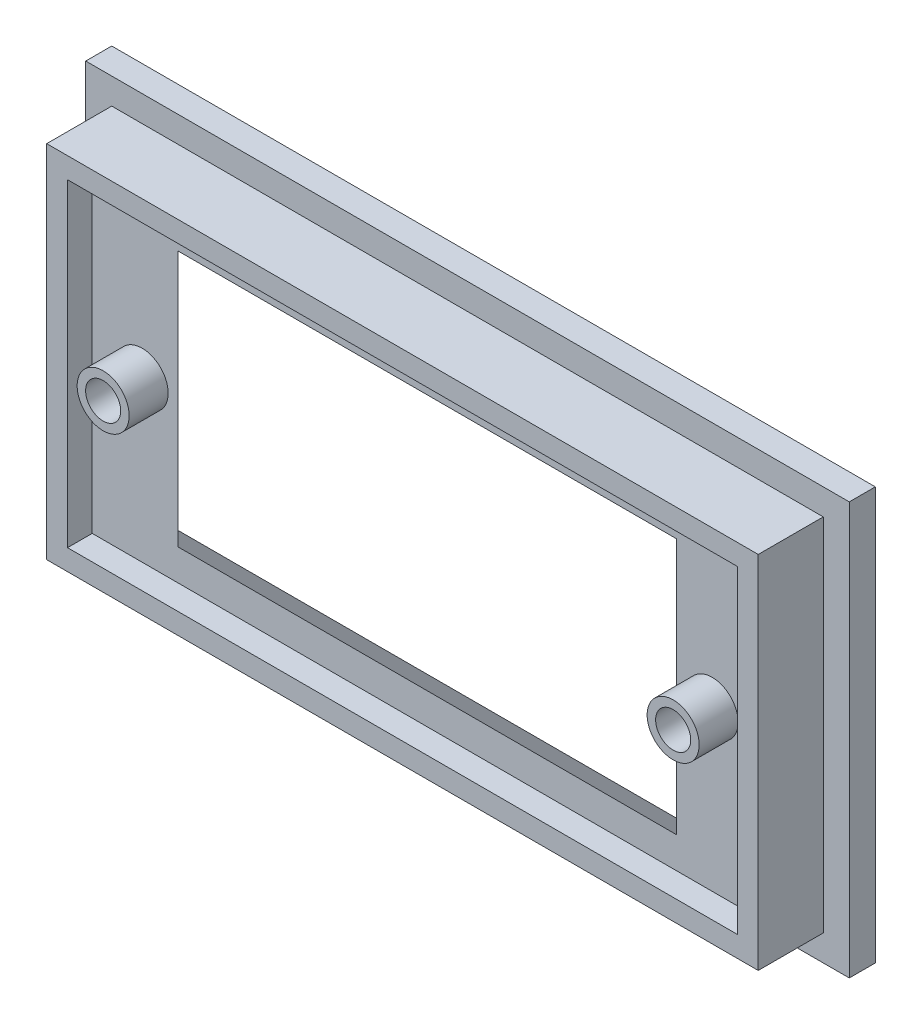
from build123d import *

# Parameters (mm, degrees)
SKICA1_W                             = 58.7
SKICA1_H                             = 31.7
P_IDAT_VYSUNUT_M1_DEPTH              = 7
SKICA2_W                             = 38.3
SKICA2_H                             = 19.7
ODEBRAT_VYSUNUT_M1_DEPTH             = 7
SKICA5_OUTSIDE_W                     = 74.116
SKICA5_OUTSIDE_H                     = 47.116
SKICA5_OUTSIDE_W_2                   = 54.7
SKICA5_OUTSIDE_H_2                   = 27.7
ODEBRAT_VYSUNUT_M5_DEPTH             = 5
SKICA6_W                             = 51.5
SKICA6_H                             = 24.5
ODEBRAT_VYSUNUT_M6_DEPTH             = 1.9
SKICA7_R                             = 2
SKICA7_R_2                           = 1.35
P_IDAT_VYSUNUT_M4_DEPTH              = 3
SKICA8_R                             = 2
SKICA8_R_2                           = 1.35
P_IDAT_VYSUNUT_M5_DEPTH              = 3
ODEBRAT_VYSUNUT_M7_REACH             = 47.591
ODEBRAT_VYSUNUT_M7_DIRECTION_2_REACH = 47.591
ODEBRAT_VYSUNUT_M8_REACH             = 47.591
ODEBRAT_VYSUNUT_M8_DIRECTION_2_REACH = 47.591


with BuildPart() as part:
    # Skica1 → P_idat vysunut_m1 (new body)
    with BuildSketch(Plane.XY):
        with Locations((-11.500302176, -2.701960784)):
            Rectangle(SKICA1_W, SKICA1_H)
    extrude(amount=P_IDAT_VYSUNUT_M1_DEPTH)

    # Skica2 → Odebrat vysunut_m1 (cut)
    with BuildSketch(Plane.XY):
        with Locations((-11.500302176, -2.701960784)):
            Rectangle(SKICA2_W, SKICA2_H)
    extrude(amount=ODEBRAT_VYSUNUT_M1_DEPTH, mode=Mode.SUBTRACT)

    # Skica5 outside → Odebrat vysunut_m5 (cut)
    with BuildSketch(Plane.XY.offset(7)):
        with Locations((-11.5, -2.702)):
            Rectangle(SKICA5_OUTSIDE_W, SKICA5_OUTSIDE_H)
        with Locations((-11.500302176, -2.701960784)):
            Rectangle(SKICA5_OUTSIDE_W_2, SKICA5_OUTSIDE_H_2, mode=Mode.SUBTRACT)
    extrude(amount=-ODEBRAT_VYSUNUT_M5_DEPTH, mode=Mode.SUBTRACT)

    # Skica6 → Odebrat vysunut_m6 (cut)
    with BuildSketch(Plane.XY.offset(7)):
        with Locations((-11.500302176, -2.701960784)):
            Rectangle(SKICA6_W, SKICA6_H)
    extrude(amount=-ODEBRAT_VYSUNUT_M6_DEPTH, mode=Mode.SUBTRACT)

    # Skica7 → P_idat vysunut_m4 (add)
    with BuildSketch(Plane.XY.offset(5.1)):
        with Locations((-33.410302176, -2.701960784)):
            Circle(SKICA7_R)
        with Locations((-33.410302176, -2.701960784)):
            Circle(SKICA7_R_2, mode=Mode.SUBTRACT)
    extrude(amount=P_IDAT_VYSUNUT_M4_DEPTH)

    # Skica8 → P_idat vysunut_m5 (add)
    with BuildSketch(Plane.XY.offset(5.1)):
        with Locations((10.409697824, -2.701960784)):
            Circle(SKICA8_R)
        with Locations((10.409697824, -2.701960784)):
            Circle(SKICA8_R_2, mode=Mode.SUBTRACT)
    extrude(amount=P_IDAT_VYSUNUT_M5_DEPTH)

    # Odebrat vysunut_m7: up to this face of the body (flat: up to its plane)
    odebrat_vysunut_m7_end = Plane(part.part.faces().sort_by_distance((-11.500302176, 7.148039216, 2.55))[0])
    # Skica12 → Odebrat vysunut_m7 (cut, up to the picked face)
    with BuildSketch(Plane(origin=(0, 0, 0), x_dir=(1, 0, 0), z_dir=(0, 1, 0)), mode=Mode.PRIVATE) as odebrat_vysunut_m7_sk1:
        Polygon((-30.650302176, -5.1), (-38.850302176, 0), (15.849697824, 0), (7.649697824, -5.1), align=None)
    odebrat_vysunut_m7_tool1 = split(extrude(odebrat_vysunut_m7_sk1.sketch, amount=ODEBRAT_VYSUNUT_M7_REACH, mode=Mode.PRIVATE), bisect_by=odebrat_vysunut_m7_end, keep=Keep.BOTH, mode=Mode.PRIVATE)
    add(odebrat_vysunut_m7_tool1.solids().sort_by(Axis((-11.500302, 0, 2.400108), (0, 1, 0)))[0], mode=Mode.SUBTRACT)

    # Odebrat vysunut_m7 direction 2: up to this face of the body (flat: up to its plane)
    odebrat_vysunut_m7_direction_2_end = Plane(part.part.faces().sort_by_distance((-11.500302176, -12.551960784, 2.55))[0])
    # Skica12 → Odebrat vysunut_m7 direction 2 (cut, up to the picked face)
    with BuildSketch(Plane(origin=(0, 0, 0), x_dir=(1, 0, 0), z_dir=(0, 1, 0)), mode=Mode.PRIVATE) as odebrat_vysunut_m7_direction_2_sk1:
        Polygon((-30.650302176, -5.1), (-38.850302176, 0), (15.849697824, 0), (7.649697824, -5.1), align=None)
    odebrat_vysunut_m7_direction_2_tool1 = split(extrude(odebrat_vysunut_m7_direction_2_sk1.sketch, amount=-ODEBRAT_VYSUNUT_M7_DIRECTION_2_REACH, mode=Mode.PRIVATE), bisect_by=odebrat_vysunut_m7_direction_2_end, keep=Keep.BOTH, mode=Mode.PRIVATE)
    add(odebrat_vysunut_m7_direction_2_tool1.solids().sort_by(Axis((-11.500302, 0, 2.400108), (0, -1, 0)))[0], mode=Mode.SUBTRACT)

    # Odebrat vysunut_m8: up to this plane
    odebrat_vysunut_m8_end = Plane(origin=(-30.650302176, 62.085276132, 5.1), z_dir=(0.5281359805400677, 0, -0.8491598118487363))
    # Skica13 → Odebrat vysunut_m8 (cut, up to the surface)
    with BuildSketch(Plane(origin=(0, 0, 0), x_dir=(0, 0, -1), z_dir=(1, 0, 0)), mode=Mode.PRIVATE) as odebrat_vysunut_m8_sk1:
        Polygon((0, 11.148039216), (-5.1, 7.148039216), (-5.1, -12.551960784), (0, -16.551960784), align=None)
    odebrat_vysunut_m8_tool1 = split(extrude(odebrat_vysunut_m8_sk1.sketch, amount=-ODEBRAT_VYSUNUT_M8_REACH, mode=Mode.PRIVATE), bisect_by=odebrat_vysunut_m8_end, keep=Keep.BOTH, mode=Mode.PRIVATE)
    add(odebrat_vysunut_m8_tool1.solids().sort_by_distance((0, -2.701961, 2.40654))[0], mode=Mode.SUBTRACT)

    # Odebrat vysunut_m8 direction 2: up to this plane
    odebrat_vysunut_m8_direction_2_end = Plane(origin=(15.849697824, 62.085276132, 0), z_dir=(-0.5281359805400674, 0, -0.8491598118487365))
    # Skica13 → Odebrat vysunut_m8 direction 2 (cut, up to the surface)
    with BuildSketch(Plane(origin=(0, 0, 0), x_dir=(0, 0, -1), z_dir=(1, 0, 0)), mode=Mode.PRIVATE) as odebrat_vysunut_m8_direction_2_sk1:
        Polygon((0, 11.148039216), (-5.1, 7.148039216), (-5.1, -12.551960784), (0, -16.551960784), align=None)
    odebrat_vysunut_m8_direction_2_tool1 = split(extrude(odebrat_vysunut_m8_direction_2_sk1.sketch, amount=ODEBRAT_VYSUNUT_M8_DIRECTION_2_REACH, mode=Mode.PRIVATE), bisect_by=odebrat_vysunut_m8_direction_2_end, keep=Keep.BOTH, mode=Mode.PRIVATE)
    add(odebrat_vysunut_m8_direction_2_tool1.solids().sort_by_distance((0, -2.701961, 2.40654))[0], mode=Mode.SUBTRACT)


solid = part.part
